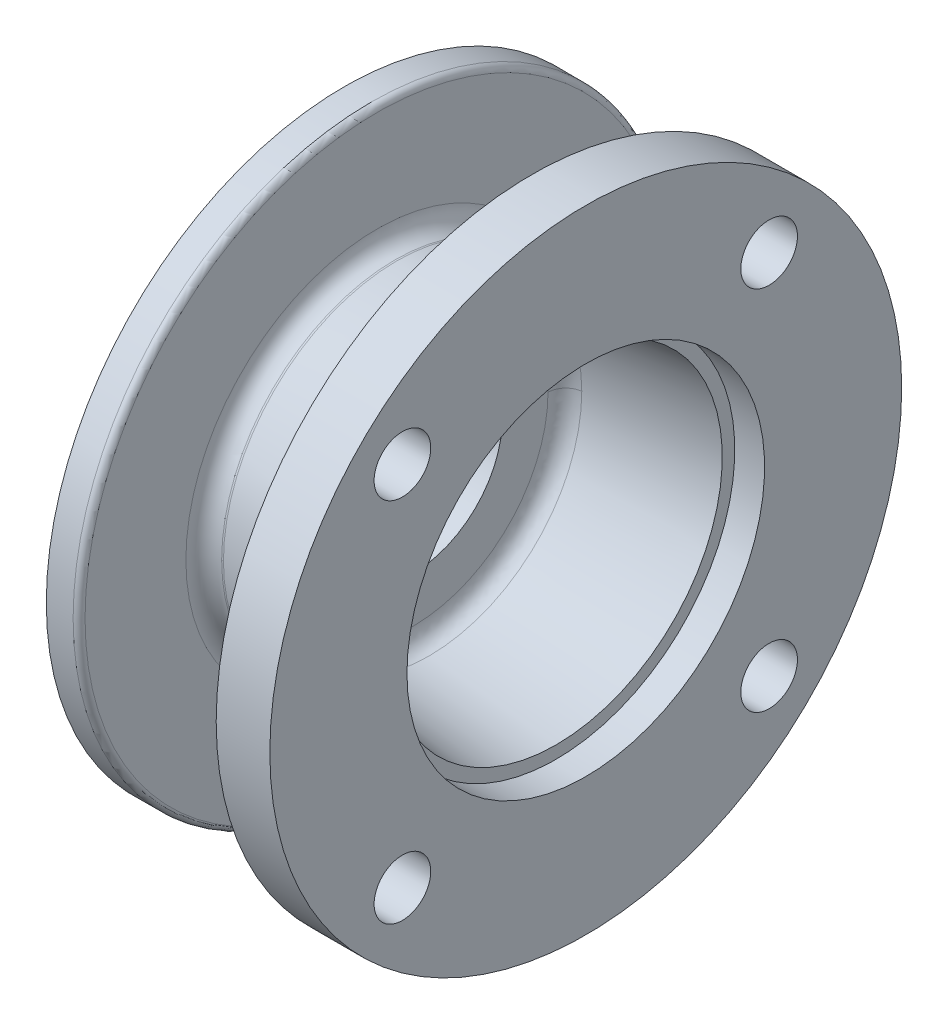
ISO-10303-21;
HEADER;
FILE_DESCRIPTION(('STEP AP214'),'2;1');
FILE_NAME('part.step','',(''),(''),'','','');
FILE_SCHEMA(('AUTOMOTIVE_DESIGN { 1 0 10303 214 1 1 1 1 }'));
ENDSEC;
DATA;
#1=APPLICATION_CONTEXT('core data for automotive mechanical design processes');
#2=APPLICATION_PROTOCOL_DEFINITION('international standard','automotive_design',2000,#1);
#3=PRODUCT_CONTEXT('',#1,'mechanical');
#4=PRODUCT('Part','Part','',(#3));
#5=PRODUCT_RELATED_PRODUCT_CATEGORY('part','',(#4));
#6=PRODUCT_DEFINITION_FORMATION('','',#4);
#7=PRODUCT_DEFINITION_CONTEXT('part definition',#1,'design');
#8=PRODUCT_DEFINITION('design','',#6,#7);
#9=PRODUCT_DEFINITION_SHAPE('','',#8);
#10=(LENGTH_UNIT() NAMED_UNIT(*) SI_UNIT(.MILLI.,.METRE.));
#11=(NAMED_UNIT(*) PLANE_ANGLE_UNIT() SI_UNIT($,.RADIAN.));
#12=(NAMED_UNIT(*) SI_UNIT($,.STERADIAN.) SOLID_ANGLE_UNIT());
#13=UNCERTAINTY_MEASURE_WITH_UNIT(LENGTH_MEASURE(1.E-05),#10,'distance_accuracy_value','');
#14=(GEOMETRIC_REPRESENTATION_CONTEXT(3) GLOBAL_UNCERTAINTY_ASSIGNED_CONTEXT((#13)) GLOBAL_UNIT_ASSIGNED_CONTEXT((#10,
#11,#12)) REPRESENTATION_CONTEXT('',''));
#15=CARTESIAN_POINT('',(0.,0.,0.));
#16=DIRECTION('',(0.,0.,1.));
#17=DIRECTION('',(1.,0.,0.));
#18=AXIS2_PLACEMENT_3D('',#15,#16,#17);
#19=CARTESIAN_POINT('',(14.184452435,0.,0.));
#20=DIRECTION('',(1.,0.,0.));
#21=DIRECTION('',(0.,1.,0.));
#22=AXIS2_PLACEMENT_3D('',#19,#20,#21);
#23=CONICAL_SURFACE('',#22,25.646235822,0.105377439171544);
#24=CARTESIAN_POINT('',(14.184452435,0.,0.));
#25=DIRECTION('',(-1.,0.,0.));
#26=DIRECTION('',(0.,0.,1.));
#27=AXIS2_PLACEMENT_3D('',#24,#25,#26);
#28=CIRCLE('',#27,25.646235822);
#29=CARTESIAN_POINT('',(14.184452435,0.,-25.646235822));
#30=VERTEX_POINT('',#29);
#31=CARTESIAN_POINT('',(14.184452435,-2.63006544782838E-09,25.646235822));
#32=VERTEX_POINT('',#31);
#33=EDGE_CURVE('E62',#30,#32,#28,.T.);
#34=ORIENTED_EDGE('',*,*,#33,.T.);
#35=CARTESIAN_POINT('',(14.184452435,0.,0.));
#36=DIRECTION('',(-1.,0.,0.));
#37=DIRECTION('',(0.,0.,1.));
#38=AXIS2_PLACEMENT_3D('',#35,#36,#37);
#39=CIRCLE('',#38,25.646235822);
#40=EDGE_CURVE('E68',#32,#30,#39,.T.);
#41=ORIENTED_EDGE('',*,*,#40,.T.);
#42=EDGE_LOOP('',(#34,#41));
#43=FACE_BOUND('',#42,.T.);
#44=CARTESIAN_POINT('',(35.5,0.,0.));
#45=DIRECTION('',(1.,0.,0.));
#46=DIRECTION('',(0.,1.,0.));
#47=AXIS2_PLACEMENT_3D('',#44,#45,#46);
#48=CIRCLE('',#47,27.900764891);
#49=CARTESIAN_POINT('',(35.5,27.900764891,0.));
#50=VERTEX_POINT('',#49);
#51=EDGE_CURVE('E20',#50,#50,#48,.T.);
#52=ORIENTED_EDGE('',*,*,#51,.T.);
#53=EDGE_LOOP('',(#52));
#54=FACE_BOUND('',#53,.T.);
#55=ADVANCED_FACE('F16',(#43,#54),#23,.F.);
#56=CARTESIAN_POINT('',(35.5,-30.36,-30.36));
#57=DIRECTION('',(-1.,0.,0.));
#58=DIRECTION('',(0.,0.,1.));
#59=AXIS2_PLACEMENT_3D('',#56,#57,#58);
#60=PLANE('',#59);
#61=ORIENTED_EDGE('',*,*,#51,.F.);
#62=EDGE_LOOP('',(#61));
#63=FACE_BOUND('',#62,.T.);
#64=CARTESIAN_POINT('',(35.5,0.,0.));
#65=DIRECTION('',(-1.,0.,0.));
#66=DIRECTION('',(0.,0.,1.));
#67=AXIS2_PLACEMENT_3D('',#64,#65,#66);
#68=CIRCLE('',#67,30.);
#69=CARTESIAN_POINT('',(35.5,0.,30.));
#70=VERTEX_POINT('',#69);
#71=EDGE_CURVE('E144',#70,#70,#68,.T.);
#72=ORIENTED_EDGE('',*,*,#71,.F.);
#73=EDGE_LOOP('',(#72));
#74=FACE_BOUND('',#73,.T.);
#75=ADVANCED_FACE('F115',(#63,#74),#60,.F.);
#76=CARTESIAN_POINT('',(11.5,0.,-22.662877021));
#77=CARTESIAN_POINT('',(11.5,-45.325754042,-22.662877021));
#78=CARTESIAN_POINT('',(11.5,-45.325754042,22.662877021));
#79=CARTESIAN_POINT('',(11.5,0.,22.662877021));
#80=CARTESIAN_POINT('',(11.5,0.,-24.276770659));
#81=CARTESIAN_POINT('',(11.5,-48.553541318,-24.276770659));
#82=CARTESIAN_POINT('',(11.5,-48.553541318,24.276770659));
#83=CARTESIAN_POINT('',(11.5,0.,24.276770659));
#84=CARTESIAN_POINT('',(12.579511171,0.,-25.476482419));
#85=CARTESIAN_POINT('',(12.579511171,-50.952964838,-25.476482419));
#86=CARTESIAN_POINT('',(12.579511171,-50.952964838,25.476482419));
#87=CARTESIAN_POINT('',(12.579511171,0.,25.476482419));
#88=CARTESIAN_POINT('',(14.184452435,0.,-25.646235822));
#89=CARTESIAN_POINT('',(14.184452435,-51.292471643,-25.646235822));
#90=CARTESIAN_POINT('',(14.184452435,-51.292471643,25.646235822));
#91=CARTESIAN_POINT('',(14.184452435,0.,25.646235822));
#92=(BOUNDED_SURFACE() B_SPLINE_SURFACE(3,3,((#76,#77,#78,#79),(#80,#81,#82,#83),(#84,#85,#86,
#87),(#88,#89,#90,#91)),.UNSPECIFIED.,.F.,.F.,.F.) B_SPLINE_SURFACE_WITH_KNOTS((4,4),(4,4),(0.,
1.),(0.,1.),.UNSPECIFIED.) GEOMETRIC_REPRESENTATION_ITEM() RATIONAL_B_SPLINE_SURFACE(((1.,
0.333333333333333,0.333333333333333,1.),(0.828909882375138,0.276303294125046,0.276303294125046,
0.828909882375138),(0.828909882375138,0.276303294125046,0.276303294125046,0.828909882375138),
(1.,0.333333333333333,0.333333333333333,1.))) REPRESENTATION_ITEM('') SURFACE());
#93=CARTESIAN_POINT('',(11.5,0.,-22.662877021));
#94=CARTESIAN_POINT('',(11.5,0.,-24.276770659));
#95=CARTESIAN_POINT('',(12.579511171,0.,-25.476482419));
#96=CARTESIAN_POINT('',(14.184452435,0.,-25.646235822));
#97=(BOUNDED_CURVE() B_SPLINE_CURVE(3,(#93,#94,#95,#96),.UNSPECIFIED.,.F.,
.F.) B_SPLINE_CURVE_WITH_KNOTS((4,4),(0.,1.),
.UNSPECIFIED.) CURVE() GEOMETRIC_REPRESENTATION_ITEM() RATIONAL_B_SPLINE_CURVE((1.,
0.828909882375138,0.828909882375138,1.)) REPRESENTATION_ITEM(''));
#98=CARTESIAN_POINT('',(11.5,0.,-22.6628770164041));
#99=VERTEX_POINT('',#98);
#100=EDGE_CURVE('E76',#30,#99,#97,.F.);
#101=CARTESIAN_POINT('',(11.5,0.,-22.662877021));
#102=CARTESIAN_POINT('',(11.5,-45.325754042,-22.662877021));
#103=CARTESIAN_POINT('',(11.5,-45.325754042,22.662877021));
#104=CARTESIAN_POINT('',(11.5,0.,22.662877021));
#105=(BOUNDED_CURVE() B_SPLINE_CURVE(3,(#101,#102,#103,#104),.UNSPECIFIED.,.F.,
.F.) B_SPLINE_CURVE_WITH_KNOTS((4,4),(0.,1.),
.UNSPECIFIED.) CURVE() GEOMETRIC_REPRESENTATION_ITEM() RATIONAL_B_SPLINE_CURVE((0.999999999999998,
0.333333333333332,0.333333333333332,0.999999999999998)) REPRESENTATION_ITEM(''));
#106=CARTESIAN_POINT('',(11.5,0.,22.6628770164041));
#107=VERTEX_POINT('',#106);
#108=EDGE_CURVE('E81',#99,#107,#105,.T.);
#109=CARTESIAN_POINT('',(11.5,0.,22.662877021));
#110=CARTESIAN_POINT('',(11.5,0.,24.276770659));
#111=CARTESIAN_POINT('',(12.579511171,0.,25.476482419));
#112=CARTESIAN_POINT('',(14.184452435,0.,25.646235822));
#113=(BOUNDED_CURVE() B_SPLINE_CURVE(3,(#109,#110,#111,#112),.UNSPECIFIED.,.F.,
.F.) B_SPLINE_CURVE_WITH_KNOTS((4,4),(0.,1.),
.UNSPECIFIED.) CURVE() GEOMETRIC_REPRESENTATION_ITEM() RATIONAL_B_SPLINE_CURVE((1.,
0.828909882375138,0.828909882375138,1.)) REPRESENTATION_ITEM(''));
#114=EDGE_CURVE('E70',#107,#32,#113,.T.);
#115=ORIENTED_EDGE('',*,*,#100,.T.);
#116=ORIENTED_EDGE('',*,*,#108,.T.);
#117=ORIENTED_EDGE('',*,*,#114,.T.);
#118=ORIENTED_EDGE('',*,*,#33,.F.);
#119=EDGE_LOOP('',(#115,#116,#117,#118));
#120=FACE_BOUND('',#119,.T.);
#121=ADVANCED_FACE('F80',(#120),#92,.F.);
#122=CARTESIAN_POINT('',(11.5,0.,22.662877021));
#123=CARTESIAN_POINT('',(11.5,45.325754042,22.662877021));
#124=CARTESIAN_POINT('',(11.5,45.325754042,-22.662877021));
#125=CARTESIAN_POINT('',(11.5,0.,-22.662877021));
#126=CARTESIAN_POINT('',(11.5,0.,24.276770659));
#127=CARTESIAN_POINT('',(11.5,48.553541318,24.276770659));
#128=CARTESIAN_POINT('',(11.5,48.553541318,-24.276770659));
#129=CARTESIAN_POINT('',(11.5,0.,-24.276770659));
#130=CARTESIAN_POINT('',(12.579511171,0.,25.476482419));
#131=CARTESIAN_POINT('',(12.579511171,50.952964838,25.476482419));
#132=CARTESIAN_POINT('',(12.579511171,50.952964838,-25.476482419));
#133=CARTESIAN_POINT('',(12.579511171,0.,-25.476482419));
#134=CARTESIAN_POINT('',(14.184452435,0.,25.646235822));
#135=CARTESIAN_POINT('',(14.184452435,51.292471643,25.646235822));
#136=CARTESIAN_POINT('',(14.184452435,51.292471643,-25.646235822));
#137=CARTESIAN_POINT('',(14.184452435,0.,-25.646235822));
#138=(BOUNDED_SURFACE() B_SPLINE_SURFACE(3,3,((#122,#123,#124,#125),(#126,#127,#128,#129),(#130,
#131,#132,#133),(#134,#135,#136,#137)),.UNSPECIFIED.,.F.,.F.,
.F.) B_SPLINE_SURFACE_WITH_KNOTS((4,4),(4,4),(0.,1.),(0.,1.),
.UNSPECIFIED.) GEOMETRIC_REPRESENTATION_ITEM() RATIONAL_B_SPLINE_SURFACE(((1.,0.333333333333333,
0.333333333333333,1.),(0.828909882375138,0.276303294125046,0.276303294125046,0.828909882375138),
(0.828909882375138,0.276303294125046,0.276303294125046,0.828909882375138),(1.,0.333333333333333,
0.333333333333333,1.))) REPRESENTATION_ITEM('') SURFACE());
#139=CARTESIAN_POINT('',(11.5,0.,22.662877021));
#140=CARTESIAN_POINT('',(11.5,45.3257540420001,22.662877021));
#141=CARTESIAN_POINT('',(11.5,45.3257540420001,-22.662877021));
#142=CARTESIAN_POINT('',(11.5,0.,-22.662877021));
#143=(BOUNDED_CURVE() B_SPLINE_CURVE(3,(#139,#140,#141,#142),.UNSPECIFIED.,.F.,
.F.) B_SPLINE_CURVE_WITH_KNOTS((4,4),(0.,1.),
.UNSPECIFIED.) CURVE() GEOMETRIC_REPRESENTATION_ITEM() RATIONAL_B_SPLINE_CURVE((0.999999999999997,
0.333333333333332,0.333333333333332,0.999999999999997)) REPRESENTATION_ITEM(''));
#144=EDGE_CURVE('E153',#107,#99,#143,.T.);
#145=ORIENTED_EDGE('',*,*,#40,.F.);
#146=ORIENTED_EDGE('',*,*,#114,.F.);
#147=ORIENTED_EDGE('',*,*,#144,.T.);
#148=ORIENTED_EDGE('',*,*,#100,.F.);
#149=EDGE_LOOP('',(#145,#146,#147,#148));
#150=FACE_BOUND('',#149,.T.);
#151=ADVANCED_FACE('F73',(#150),#138,.F.);
#152=CARTESIAN_POINT('',(40.5,0.,0.));
#153=DIRECTION('',(-1.,0.,0.));
#154=DIRECTION('',(0.,0.,1.));
#155=AXIS2_PLACEMENT_3D('',#152,#153,#154);
#156=CYLINDRICAL_SURFACE('',#155,30.);
#157=CARTESIAN_POINT('',(40.5,0.,0.));
#158=DIRECTION('',(-1.,0.,0.));
#159=DIRECTION('',(0.,0.,1.));
#160=AXIS2_PLACEMENT_3D('',#157,#158,#159);
#161=CIRCLE('',#160,30.);
#162=CARTESIAN_POINT('',(40.5,0.,30.));
#163=VERTEX_POINT('',#162);
#164=EDGE_CURVE('E155',#163,#163,#161,.F.);
#165=ORIENTED_EDGE('',*,*,#164,.T.);
#166=EDGE_LOOP('',(#165));
#167=FACE_BOUND('',#166,.T.);
#168=ORIENTED_EDGE('',*,*,#71,.T.);
#169=EDGE_LOOP('',(#168));
#170=FACE_BOUND('',#169,.T.);
#171=ADVANCED_FACE('F126',(#167,#170),#156,.F.);
#172=CARTESIAN_POINT('',(11.5,-22.934831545,-22.934831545));
#173=DIRECTION('',(-1.,0.,0.));
#174=DIRECTION('',(0.,0.,1.));
#175=AXIS2_PLACEMENT_3D('',#172,#173,#174);
#176=PLANE('',#175);
#177=CARTESIAN_POINT('',(11.5,0.,0.));
#178=DIRECTION('',(-1.,0.,0.));
#179=DIRECTION('',(0.,0.,1.));
#180=AXIS2_PLACEMENT_3D('',#177,#178,#179);
#181=CIRCLE('',#180,15.);
#182=CARTESIAN_POINT('',(11.5,0.,15.));
#183=VERTEX_POINT('',#182);
#184=EDGE_CURVE('E158',#183,#183,#181,.F.);
#185=ORIENTED_EDGE('',*,*,#184,.F.);
#186=EDGE_LOOP('',(#185));
#187=FACE_BOUND('',#186,.T.);
#188=ORIENTED_EDGE('',*,*,#108,.F.);
#189=ORIENTED_EDGE('',*,*,#144,.F.);
#190=EDGE_LOOP('',(#188,#189));
#191=FACE_BOUND('',#190,.T.);
#192=ADVANCED_FACE('F259',(#187,#191),#176,.F.);
#193=CARTESIAN_POINT('',(40.5,-53.636,-53.636));
#194=DIRECTION('',(-1.,0.,0.));
#195=DIRECTION('',(0.,0.,1.));
#196=AXIS2_PLACEMENT_3D('',#193,#194,#195);
#197=PLANE('',#196);
#198=ORIENTED_EDGE('',*,*,#164,.F.);
#199=EDGE_LOOP('',(#198));
#200=FACE_BOUND('',#199,.T.);
#201=CARTESIAN_POINT('',(40.5,30.759144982,-30.759144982));
#202=DIRECTION('',(1.,0.,0.));
#203=DIRECTION('',(0.,0.,-1.));
#204=AXIS2_PLACEMENT_3D('',#201,#202,#203);
#205=CIRCLE('',#204,4.75);
#206=CARTESIAN_POINT('',(40.5,30.759144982,-35.509144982));
#207=VERTEX_POINT('',#206);
#208=EDGE_CURVE('E178',#207,#207,#205,.T.);
#209=ORIENTED_EDGE('',*,*,#208,.F.);
#210=EDGE_LOOP('',(#209));
#211=FACE_BOUND('',#210,.T.);
#212=CARTESIAN_POINT('',(40.5,30.759144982,30.759144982));
#213=DIRECTION('',(1.,0.,0.));
#214=DIRECTION('',(0.,0.,-1.));
#215=AXIS2_PLACEMENT_3D('',#212,#213,#214);
#216=CIRCLE('',#215,4.75);
#217=CARTESIAN_POINT('',(40.5,30.759144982,26.009144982));
#218=VERTEX_POINT('',#217);
#219=EDGE_CURVE('E174',#218,#218,#216,.T.);
#220=ORIENTED_EDGE('',*,*,#219,.F.);
#221=EDGE_LOOP('',(#220));
#222=FACE_BOUND('',#221,.T.);
#223=CARTESIAN_POINT('',(40.5,-30.759144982,-30.759144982));
#224=DIRECTION('',(1.,0.,0.));
#225=DIRECTION('',(0.,0.,-1.));
#226=AXIS2_PLACEMENT_3D('',#223,#224,#225);
#227=CIRCLE('',#226,4.75);
#228=CARTESIAN_POINT('',(40.5,-30.759144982,-35.509144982));
#229=VERTEX_POINT('',#228);
#230=EDGE_CURVE('E170',#229,#229,#227,.T.);
#231=ORIENTED_EDGE('',*,*,#230,.F.);
#232=EDGE_LOOP('',(#231));
#233=FACE_BOUND('',#232,.T.);
#234=CARTESIAN_POINT('',(40.5,-30.759144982,30.759144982));
#235=DIRECTION('',(1.,0.,0.));
#236=DIRECTION('',(0.,0.,-1.));
#237=AXIS2_PLACEMENT_3D('',#234,#235,#236);
#238=CIRCLE('',#237,4.75);
#239=CARTESIAN_POINT('',(40.5,-30.759144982,26.009144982));
#240=VERTEX_POINT('',#239);
#241=EDGE_CURVE('E166',#240,#240,#238,.T.);
#242=ORIENTED_EDGE('',*,*,#241,.F.);
#243=EDGE_LOOP('',(#242));
#244=FACE_BOUND('',#243,.T.);
#245=CARTESIAN_POINT('',(40.5,0.,0.));
#246=DIRECTION('',(-1.,0.,0.));
#247=DIRECTION('',(0.,0.,1.));
#248=AXIS2_PLACEMENT_3D('',#245,#246,#247);
#249=CIRCLE('',#248,53.);
#250=CARTESIAN_POINT('',(40.5,0.,53.));
#251=VERTEX_POINT('',#250);
#252=EDGE_CURVE('E162',#251,#251,#249,.F.);
#253=ORIENTED_EDGE('',*,*,#252,.T.);
#254=EDGE_LOOP('',(#253));
#255=FACE_BOUND('',#254,.T.);
#256=ADVANCED_FACE('F268',(#200,#211,#222,#233,#244,#255),#197,.F.);
#257=CARTESIAN_POINT('',(11.5,0.,0.));
#258=DIRECTION('',(-1.,0.,0.));
#259=DIRECTION('',(0.,0.,1.));
#260=AXIS2_PLACEMENT_3D('',#257,#258,#259);
#261=CYLINDRICAL_SURFACE('',#260,15.);
#262=ORIENTED_EDGE('',*,*,#184,.T.);
#263=EDGE_LOOP('',(#262));
#264=FACE_BOUND('',#263,.T.);
#265=CARTESIAN_POINT('',(0.,0.,0.));
#266=DIRECTION('',(-1.,0.,0.));
#267=DIRECTION('',(0.,0.,1.));
#268=AXIS2_PLACEMENT_3D('',#265,#266,#267);
#269=CIRCLE('',#268,15.);
#270=CARTESIAN_POINT('',(0.,0.,15.));
#271=VERTEX_POINT('',#270);
#272=EDGE_CURVE('E182',#271,#271,#269,.T.);
#273=ORIENTED_EDGE('',*,*,#272,.T.);
#274=EDGE_LOOP('',(#273));
#275=FACE_BOUND('',#274,.T.);
#276=ADVANCED_FACE('F410',(#264,#275),#261,.F.);
#277=CARTESIAN_POINT('',(40.5,0.,0.));
#278=DIRECTION('',(-1.,0.,0.));
#279=DIRECTION('',(0.,0.,1.));
#280=AXIS2_PLACEMENT_3D('',#277,#278,#279);
#281=CYLINDRICAL_SURFACE('',#280,53.);
#282=CARTESIAN_POINT('',(31.5,0.,0.));
#283=DIRECTION('',(-1.,0.,0.));
#284=DIRECTION('',(0.,0.,1.));
#285=AXIS2_PLACEMENT_3D('',#282,#283,#284);
#286=CIRCLE('',#285,53.);
#287=CARTESIAN_POINT('',(31.5,0.,53.));
#288=VERTEX_POINT('',#287);
#289=EDGE_CURVE('E186',#288,#288,#286,.F.);
#290=ORIENTED_EDGE('',*,*,#289,.T.);
#291=EDGE_LOOP('',(#290));
#292=FACE_BOUND('',#291,.T.);
#293=ORIENTED_EDGE('',*,*,#252,.F.);
#294=EDGE_LOOP('',(#293));
#295=FACE_BOUND('',#294,.T.);
#296=ADVANCED_FACE('F406',(#292,#295),#281,.T.);
#297=CARTESIAN_POINT('',(31.5,-30.759144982,30.759144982));
#298=DIRECTION('',(1.,0.,0.));
#299=DIRECTION('',(0.,0.,-1.));
#300=AXIS2_PLACEMENT_3D('',#297,#298,#299);
#301=CYLINDRICAL_SURFACE('',#300,4.75);
#302=ORIENTED_EDGE('',*,*,#241,.T.);
#303=EDGE_LOOP('',(#302));
#304=FACE_BOUND('',#303,.T.);
#305=CARTESIAN_POINT('',(31.5,-30.759144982,30.759144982));
#306=DIRECTION('',(1.,0.,0.));
#307=DIRECTION('',(0.,0.,-1.));
#308=AXIS2_PLACEMENT_3D('',#305,#306,#307);
#309=CIRCLE('',#308,4.75);
#310=CARTESIAN_POINT('',(31.5,-30.759144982,26.009144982));
#311=VERTEX_POINT('',#310);
#312=EDGE_CURVE('E190',#311,#311,#309,.F.);
#313=ORIENTED_EDGE('',*,*,#312,.T.);
#314=EDGE_LOOP('',(#313));
#315=FACE_BOUND('',#314,.T.);
#316=ADVANCED_FACE('F409',(#304,#315),#301,.F.);
#317=CARTESIAN_POINT('',(31.5,-30.759144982,-30.759144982));
#318=DIRECTION('',(1.,0.,0.));
#319=DIRECTION('',(0.,0.,-1.));
#320=AXIS2_PLACEMENT_3D('',#317,#318,#319);
#321=CYLINDRICAL_SURFACE('',#320,4.75);
#322=ORIENTED_EDGE('',*,*,#230,.T.);
#323=EDGE_LOOP('',(#322));
#324=FACE_BOUND('',#323,.T.);
#325=CARTESIAN_POINT('',(31.5,-30.759144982,-30.759144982));
#326=DIRECTION('',(1.,0.,0.));
#327=DIRECTION('',(0.,0.,-1.));
#328=AXIS2_PLACEMENT_3D('',#325,#326,#327);
#329=CIRCLE('',#328,4.75);
#330=CARTESIAN_POINT('',(31.5,-30.759144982,-35.509144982));
#331=VERTEX_POINT('',#330);
#332=EDGE_CURVE('E194',#331,#331,#329,.F.);
#333=ORIENTED_EDGE('',*,*,#332,.T.);
#334=EDGE_LOOP('',(#333));
#335=FACE_BOUND('',#334,.T.);
#336=ADVANCED_FACE('F432',(#324,#335),#321,.F.);
#337=CARTESIAN_POINT('',(31.5,30.759144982,30.759144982));
#338=DIRECTION('',(1.,0.,0.));
#339=DIRECTION('',(0.,0.,-1.));
#340=AXIS2_PLACEMENT_3D('',#337,#338,#339);
#341=CYLINDRICAL_SURFACE('',#340,4.75);
#342=ORIENTED_EDGE('',*,*,#219,.T.);
#343=EDGE_LOOP('',(#342));
#344=FACE_BOUND('',#343,.T.);
#345=CARTESIAN_POINT('',(31.5,30.759144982,30.759144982));
#346=DIRECTION('',(1.,0.,0.));
#347=DIRECTION('',(0.,0.,-1.));
#348=AXIS2_PLACEMENT_3D('',#345,#346,#347);
#349=CIRCLE('',#348,4.75);
#350=CARTESIAN_POINT('',(31.5,30.759144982,26.009144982));
#351=VERTEX_POINT('',#350);
#352=EDGE_CURVE('E198',#351,#351,#349,.F.);
#353=ORIENTED_EDGE('',*,*,#352,.T.);
#354=EDGE_LOOP('',(#353));
#355=FACE_BOUND('',#354,.T.);
#356=ADVANCED_FACE('F437',(#344,#355),#341,.F.);
#357=CARTESIAN_POINT('',(31.5,30.759144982,-30.759144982));
#358=DIRECTION('',(1.,0.,0.));
#359=DIRECTION('',(0.,0.,-1.));
#360=AXIS2_PLACEMENT_3D('',#357,#358,#359);
#361=CYLINDRICAL_SURFACE('',#360,4.75);
#362=ORIENTED_EDGE('',*,*,#208,.T.);
#363=EDGE_LOOP('',(#362));
#364=FACE_BOUND('',#363,.T.);
#365=CARTESIAN_POINT('',(31.5,30.759144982,-30.759144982));
#366=DIRECTION('',(1.,0.,0.));
#367=DIRECTION('',(0.,0.,-1.));
#368=AXIS2_PLACEMENT_3D('',#365,#366,#367);
#369=CIRCLE('',#368,4.75);
#370=CARTESIAN_POINT('',(31.5,30.759144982,-35.509144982));
#371=VERTEX_POINT('',#370);
#372=EDGE_CURVE('E202',#371,#371,#369,.F.);
#373=ORIENTED_EDGE('',*,*,#372,.T.);
#374=EDGE_LOOP('',(#373));
#375=FACE_BOUND('',#374,.T.);
#376=ADVANCED_FACE('F443',(#364,#375),#361,.F.);
#377=CARTESIAN_POINT('',(0.,-50.6,50.6));
#378=DIRECTION('',(1.,0.,0.));
#379=DIRECTION('',(0.,0.,-1.));
#380=AXIS2_PLACEMENT_3D('',#377,#378,#379);
#381=PLANE('',#380);
#382=ORIENTED_EDGE('',*,*,#272,.F.);
#383=EDGE_LOOP('',(#382));
#384=FACE_BOUND('',#383,.T.);
#385=CARTESIAN_POINT('',(0.,0.,0.));
#386=DIRECTION('',(-1.,0.,0.));
#387=DIRECTION('',(0.,0.,1.));
#388=AXIS2_PLACEMENT_3D('',#385,#386,#387);
#389=CIRCLE('',#388,50.);
#390=CARTESIAN_POINT('',(0.,0.,50.));
#391=VERTEX_POINT('',#390);
#392=EDGE_CURVE('E207',#391,#391,#389,.T.);
#393=ORIENTED_EDGE('',*,*,#392,.T.);
#394=EDGE_LOOP('',(#393));
#395=FACE_BOUND('',#394,.T.);
#396=ADVANCED_FACE('F238',(#384,#395),#381,.F.);
#397=CARTESIAN_POINT('',(31.5,-53.636,53.636));
#398=DIRECTION('',(1.,0.,0.));
#399=DIRECTION('',(0.,0.,-1.));
#400=AXIS2_PLACEMENT_3D('',#397,#398,#399);
#401=PLANE('',#400);
#402=CARTESIAN_POINT('',(31.5,0.,-34.199426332));
#403=CARTESIAN_POINT('',(31.5,-0.361867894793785,-34.1994284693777));
#404=CARTESIAN_POINT('',(31.5,-0.723736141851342,-34.1936829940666));
#405=CARTESIAN_POINT('',(31.5,-1.45858225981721,-34.1703474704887));
#406=CARTESIAN_POINT('',(31.5,-1.83154841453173,-34.1523874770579));
#407=CARTESIAN_POINT('',(31.5,-2.5884930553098,-34.1035017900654));
#408=CARTESIAN_POINT('',(31.5,-2.97244621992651,-34.0721834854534));
#409=CARTESIAN_POINT('',(31.5,-3.75118205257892,-33.9954006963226));
#410=CARTESIAN_POINT('',(31.5,-4.14592378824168,-33.949520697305));
#411=CARTESIAN_POINT('',(31.5,-4.94595592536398,-33.8423735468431));
#412=CARTESIAN_POINT('',(31.5,-5.35118763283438,-33.7806678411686));
#413=CARTESIAN_POINT('',(31.5,-6.17180774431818,-33.6405735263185));
#414=CARTESIAN_POINT('',(31.5,-6.58711742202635,-33.5617235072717));
#415=CARTESIAN_POINT('',(31.5,-7.42737653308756,-33.3859962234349));
#416=CARTESIAN_POINT('',(31.5,-7.85222484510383,-33.2886352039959));
#417=CARTESIAN_POINT('',(31.5,-8.71090501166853,-33.0745018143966));
#418=CARTESIAN_POINT('',(31.5,-9.14461093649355,-32.9572242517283));
#419=CARTESIAN_POINT('',(31.5,-10.02019633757,-32.7018451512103));
#420=CARTESIAN_POINT('',(31.5,-10.461922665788,-32.5632183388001));
#421=CARTESIAN_POINT('',(31.5,-11.3525707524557,-32.2637136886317));
#422=CARTESIAN_POINT('',(31.5,-11.8013098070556,-32.1022923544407));
#423=CARTESIAN_POINT('',(31.5,-12.7048233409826,-31.7557743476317));
#424=CARTESIAN_POINT('',(31.5,-13.1593833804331,-31.5701183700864));
#425=CARTESIAN_POINT('',(31.5,-14.073184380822,-31.1737299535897));
#426=CARTESIAN_POINT('',(31.5,-14.5321772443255,-30.9624254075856));
#427=CARTESIAN_POINT('',(31.5,-15.4532840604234,-30.5133857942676));
#428=CARTESIAN_POINT('',(31.5,-15.9151147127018,-30.2750694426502));
#429=CARTESIAN_POINT('',(31.5,-16.8401236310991,-29.7707265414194));
#430=CARTESIAN_POINT('',(31.5,-17.3029823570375,-29.5041137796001));
#431=CARTESIAN_POINT('',(31.5,-18.228055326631,-28.9420034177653));
#432=CARTESIAN_POINT('',(31.5,-18.689913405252,-28.6459195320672));
#433=CARTESIAN_POINT('',(31.5,-19.6107735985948,-28.0238310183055));
#434=CARTESIAN_POINT('',(31.5,-20.0693833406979,-27.6972454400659));
#435=CARTESIAN_POINT('',(31.5,-20.9813203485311,-27.0132926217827));
#436=CARTESIAN_POINT('',(31.5,-21.4342204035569,-26.6553556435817));
#437=CARTESIAN_POINT('',(31.5,-22.3321068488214,-25.908052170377));
#438=CARTESIAN_POINT('',(31.5,-22.7766336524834,-25.5181333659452));
#439=CARTESIAN_POINT('',(31.5,-23.6549549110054,-24.7064703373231));
#440=CARTESIAN_POINT('',(31.5,-24.0882610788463,-24.2841976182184));
#441=CARTESIAN_POINT('',(31.5,-24.9411594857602,-23.4077214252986));
#442=CARTESIAN_POINT('',(31.5,-25.3602397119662,-22.9530196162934));
#443=CARTESIAN_POINT('',(31.5,-26.1815744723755,-22.0119067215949));
#444=CARTESIAN_POINT('',(31.5,-26.5832995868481,-21.5250335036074));
#445=CARTESIAN_POINT('',(31.5,-27.3667221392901,-20.5201606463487));
#446=CARTESIAN_POINT('',(31.5,-27.7478803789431,-20.001740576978));
#447=CARTESIAN_POINT('',(31.5,-28.4869277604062,-18.934740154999));
#448=CARTESIAN_POINT('',(31.5,-28.8442768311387,-18.3857855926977));
#449=CARTESIAN_POINT('',(31.5,-29.5324712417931,-17.2591081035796));
#450=CARTESIAN_POINT('',(31.5,-29.8627854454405,-16.6810609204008));
#451=CARTESIAN_POINT('',(31.5,-30.4937790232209,-15.4979425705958));
#452=CARTESIAN_POINT('',(31.5,-30.7939473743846,-14.8925980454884));
#453=CARTESIAN_POINT('',(31.5,-31.2183068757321,-13.9690539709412));
#454=CARTESIAN_POINT('',(31.5,-31.3560669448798,-13.6570191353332));
#455=CARTESIAN_POINT('',(31.5,-31.6230101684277,-13.0270378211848));
#456=CARTESIAN_POINT('',(31.5,-31.7521357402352,-12.7090668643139));
#457=CARTESIAN_POINT('',(31.5,-32.0014626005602,-12.0675702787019));
#458=CARTESIAN_POINT('',(31.5,-32.1216090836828,-11.7440233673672));
#459=CARTESIAN_POINT('',(31.5,-32.3526570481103,-11.0917392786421));
#460=CARTESIAN_POINT('',(31.5,-32.4635068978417,-10.7629838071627));
#461=CARTESIAN_POINT('',(31.5,-32.6756580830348,-10.1006744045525));
#462=CARTESIAN_POINT('',(31.5,-32.7769112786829,-9.76710505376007));
#463=CARTESIAN_POINT('',(31.5,-32.9695879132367,-9.09558011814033));
#464=CARTESIAN_POINT('',(31.5,-33.0609670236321,-8.75761181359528));
#465=CARTESIAN_POINT('',(31.5,-33.2336375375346,-8.07772167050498));
#466=CARTESIAN_POINT('',(31.5,-33.3148887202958,-7.73578961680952));
#467=CARTESIAN_POINT('',(31.5,-33.4670706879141,-7.048423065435));
#468=CARTESIAN_POINT('',(31.5,-33.5379656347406,-6.70298063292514));
#469=CARTESIAN_POINT('',(31.5,-33.6692292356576,-6.00906107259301));
#470=CARTESIAN_POINT('',(31.5,-33.7295666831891,-5.66057804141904));
#471=CARTESIAN_POINT('',(31.5,-33.8395376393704,-4.96105965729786));
#472=CARTESIAN_POINT('',(31.5,-33.8891447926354,-4.61002016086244));
#473=CARTESIAN_POINT('',(31.5,-33.9775070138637,-3.9058837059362));
#474=CARTESIAN_POINT('',(31.5,-34.0162407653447,-3.55278407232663));
#475=CARTESIAN_POINT('',(31.5,-34.082738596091,-2.84503241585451));
#476=CARTESIAN_POINT('',(31.5,-34.110486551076,-2.49037887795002));
#477=CARTESIAN_POINT('',(31.5,-34.1549266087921,-1.78003232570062));
#478=CARTESIAN_POINT('',(31.5,-34.171607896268,-1.42433863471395));
#479=CARTESIAN_POINT('',(31.5,-34.19386047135,-0.712430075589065));
#480=CARTESIAN_POINT('',(31.5,-34.1994263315,-0.356215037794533));
#481=CARTESIAN_POINT('',(31.5,-34.1994263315,0.356215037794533));
#482=CARTESIAN_POINT('',(31.5,-34.19386047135,0.712430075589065));
#483=CARTESIAN_POINT('',(31.5,-34.171607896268,1.42433863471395));
#484=CARTESIAN_POINT('',(31.5,-34.1549266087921,1.78003232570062));
#485=CARTESIAN_POINT('',(31.5,-34.110486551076,2.49037887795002));
#486=CARTESIAN_POINT('',(31.5,-34.082738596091,2.84503241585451));
#487=CARTESIAN_POINT('',(31.5,-34.0162407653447,3.55278407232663));
#488=CARTESIAN_POINT('',(31.5,-33.9775070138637,3.9058837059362));
#489=CARTESIAN_POINT('',(31.5,-33.8891447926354,4.61002016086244));
#490=CARTESIAN_POINT('',(31.5,-33.8395376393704,4.96105965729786));
#491=CARTESIAN_POINT('',(31.5,-33.7295666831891,5.66057804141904));
#492=CARTESIAN_POINT('',(31.5,-33.6692292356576,6.00906107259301));
#493=CARTESIAN_POINT('',(31.5,-33.5379656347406,6.70298063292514));
#494=CARTESIAN_POINT('',(31.5,-33.4670706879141,7.048423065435));
#495=CARTESIAN_POINT('',(31.5,-33.3148887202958,7.73578961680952));
#496=CARTESIAN_POINT('',(31.5,-33.2336375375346,8.07772167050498));
#497=CARTESIAN_POINT('',(31.5,-33.0609670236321,8.75761181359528));
#498=CARTESIAN_POINT('',(31.5,-32.9695879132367,9.09558011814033));
#499=CARTESIAN_POINT('',(31.5,-32.7769112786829,9.76710505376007));
#500=CARTESIAN_POINT('',(31.5,-32.6756580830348,10.1006744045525));
#501=CARTESIAN_POINT('',(31.5,-32.4635068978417,10.7629838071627));
#502=CARTESIAN_POINT('',(31.5,-32.3526570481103,11.0917392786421));
#503=CARTESIAN_POINT('',(31.5,-32.1216090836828,11.7440233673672));
#504=CARTESIAN_POINT('',(31.5,-32.0014626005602,12.0675702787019));
#505=CARTESIAN_POINT('',(31.5,-31.7521357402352,12.7090668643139));
#506=CARTESIAN_POINT('',(31.5,-31.6230101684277,13.0270378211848));
#507=CARTESIAN_POINT('',(31.5,-31.3560669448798,13.6570191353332));
#508=CARTESIAN_POINT('',(31.5,-31.2183068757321,13.9690539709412));
#509=CARTESIAN_POINT('',(31.5,-30.7939473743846,14.8925980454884));
#510=CARTESIAN_POINT('',(31.5,-30.4937790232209,15.4979425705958));
#511=CARTESIAN_POINT('',(31.5,-29.8627854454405,16.6810609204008));
#512=CARTESIAN_POINT('',(31.5,-29.5324712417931,17.2591081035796));
#513=CARTESIAN_POINT('',(31.5,-28.8442768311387,18.3857855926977));
#514=CARTESIAN_POINT('',(31.5,-28.4869277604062,18.934740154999));
#515=CARTESIAN_POINT('',(31.5,-27.7478803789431,20.001740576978));
#516=CARTESIAN_POINT('',(31.5,-27.3667221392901,20.5201606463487));
#517=CARTESIAN_POINT('',(31.5,-26.5832995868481,21.5250335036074));
#518=CARTESIAN_POINT('',(31.5,-26.1815744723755,22.0119067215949));
#519=CARTESIAN_POINT('',(31.5,-25.3602397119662,22.9530196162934));
#520=CARTESIAN_POINT('',(31.5,-24.9411594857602,23.4077214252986));
#521=CARTESIAN_POINT('',(31.5,-24.0882610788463,24.2841976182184));
#522=CARTESIAN_POINT('',(31.5,-23.6549549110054,24.7064703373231));
#523=CARTESIAN_POINT('',(31.5,-22.7766336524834,25.5181333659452));
#524=CARTESIAN_POINT('',(31.5,-22.3321068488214,25.908052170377));
#525=CARTESIAN_POINT('',(31.5,-21.4342204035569,26.6553556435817));
#526=CARTESIAN_POINT('',(31.5,-20.9813203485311,27.0132926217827));
#527=CARTESIAN_POINT('',(31.5,-20.0693833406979,27.6972454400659));
#528=CARTESIAN_POINT('',(31.5,-19.6107735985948,28.0238310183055));
#529=CARTESIAN_POINT('',(31.5,-18.689913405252,28.6459195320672));
#530=CARTESIAN_POINT('',(31.5,-18.228055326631,28.9420034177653));
#531=CARTESIAN_POINT('',(31.5,-17.3029823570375,29.5041137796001));
#532=CARTESIAN_POINT('',(31.5,-16.8401236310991,29.7707265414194));
#533=CARTESIAN_POINT('',(31.5,-15.9151147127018,30.2750694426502));
#534=CARTESIAN_POINT('',(31.5,-15.4532840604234,30.5133857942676));
#535=CARTESIAN_POINT('',(31.5,-14.5321772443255,30.9624254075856));
#536=CARTESIAN_POINT('',(31.5,-14.073184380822,31.1737299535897));
#537=CARTESIAN_POINT('',(31.5,-13.1593833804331,31.5701183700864));
#538=CARTESIAN_POINT('',(31.5,-12.7048233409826,31.7557743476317));
#539=CARTESIAN_POINT('',(31.5,-11.8013098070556,32.1022923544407));
#540=CARTESIAN_POINT('',(31.5,-11.3525707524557,32.2637136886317));
#541=CARTESIAN_POINT('',(31.5,-10.461922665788,32.5632183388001));
#542=CARTESIAN_POINT('',(31.5,-10.02019633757,32.7018451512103));
#543=CARTESIAN_POINT('',(31.5,-9.14461093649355,32.9572242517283));
#544=CARTESIAN_POINT('',(31.5,-8.71090501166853,33.0745018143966));
#545=CARTESIAN_POINT('',(31.5,-7.85222484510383,33.2886352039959));
#546=CARTESIAN_POINT('',(31.5,-7.42737653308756,33.3859962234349));
#547=CARTESIAN_POINT('',(31.5,-6.58711742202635,33.5617235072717));
#548=CARTESIAN_POINT('',(31.5,-6.17180774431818,33.6405735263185));
#549=CARTESIAN_POINT('',(31.5,-5.35118763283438,33.7806678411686));
#550=CARTESIAN_POINT('',(31.5,-4.94595592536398,33.8423735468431));
#551=CARTESIAN_POINT('',(31.5,-4.14592378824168,33.949520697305));
#552=CARTESIAN_POINT('',(31.5,-3.75118205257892,33.9954006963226));
#553=CARTESIAN_POINT('',(31.5,-2.97244621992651,34.0721834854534));
#554=CARTESIAN_POINT('',(31.5,-2.5884930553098,34.1035017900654));
#555=CARTESIAN_POINT('',(31.5,-1.83154841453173,34.1523874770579));
#556=CARTESIAN_POINT('',(31.5,-1.45858225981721,34.1703474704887));
#557=CARTESIAN_POINT('',(31.5,-0.723736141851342,34.1936829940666));
#558=CARTESIAN_POINT('',(31.5,-0.361867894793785,34.1994284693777));
#559=CARTESIAN_POINT('',(31.5,0.,34.199426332));
#560=B_SPLINE_CURVE_WITH_KNOTS('',3,(#402,#403,#404,#405,#406,#407,#408,#409,#410,#411,#412,
#413,#414,#415,#416,#417,#418,#419,#420,#421,#422,#423,#424,#425,#426,#427,#428,#429,#430,#431,
#432,#433,#434,#435,#436,#437,#438,#439,#440,#441,#442,#443,#444,#445,#446,#447,#448,#449,#450,
#451,#452,#453,#454,#455,#456,#457,#458,#459,#460,#461,#462,#463,#464,#465,#466,#467,#468,#469,
#470,#471,#472,#473,#474,#475,#476,#477,#478,#479,#480,#481,#482,#483,#484,#485,#486,#487,#488,
#489,#490,#491,#492,#493,#494,#495,#496,#497,#498,#499,#500,#501,#502,#503,#504,#505,#506,#507,
#508,#509,#510,#511,#512,#513,#514,#515,#516,#517,#518,#519,#520,#521,#522,#523,#524,#525,#526,
#527,#528,#529,#530,#531,#532,#533,#534,#535,#536,#537,#538,#539,#540,#541,#542,#543,#544,#545,
#546,#547,#548,#549,#550,#551,#552,#553,#554,#555,#556,#557,#558,#559),.UNSPECIFIED.,.F.,.F.,(4,
2,2,2,2,2,2,2,2,2,2,2,2,2,2,2,2,2,2,2,2,2,2,2,2,2,2,2,2,2,2,2,2,2,2,2,2,2,2,2,2,2,2,2,2,2,2,2,2,
2,2,2,2,2,2,2,2,2,2,2,2,2,2,2,2,2,2,2,2,2,2,2,2,2,2,2,2,2,4),(0.,1.08555932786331,
2.20555412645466,3.36101925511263,4.55297509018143,5.78241872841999,7.05031398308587,
8.35758010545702,9.70507918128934,11.0936021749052,12.5238536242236,13.9964350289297,
15.5118270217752,17.0703704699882,18.6722467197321,20.3174572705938,22.0058032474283,
23.7368651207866,25.5099832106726,27.3242395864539,29.1784420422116,31.0711108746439,
33.0004692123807,34.9644376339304,36.9606337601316,38.9863774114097,40.00952766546,
41.0389328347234,42.0741800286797,43.1148409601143,44.1604728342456,45.2106193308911,
46.2648116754,47.3225697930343,48.383403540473,49.4468140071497,50.5122948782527,
51.5793338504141,52.6474140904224,53.7160157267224,54.7846173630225,55.8526976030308,
56.9197365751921,57.9852174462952,59.0486279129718,60.1094616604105,61.1672197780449,
62.2214121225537,63.2715586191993,64.3171904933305,65.3578514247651,66.3930986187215,
67.4225037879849,68.4456540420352,70.4713976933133,72.4675938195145,74.4315622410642,
76.3609205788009,78.2535894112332,80.107791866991,81.9220482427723,83.6951663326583,
85.4262282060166,87.1145741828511,88.7597847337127,90.3616609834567,91.9202044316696,
93.4355964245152,94.9081778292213,96.3384292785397,97.7269522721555,99.0744513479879,
100.381717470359,101.649612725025,102.879056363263,104.071012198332,105.22647732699,
106.346472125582,107.432031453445),.UNSPECIFIED.);
#561=CARTESIAN_POINT('',(31.5,0.,34.1994263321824));
#562=VERTEX_POINT('',#561);
#563=CARTESIAN_POINT('',(31.5,0.,-34.1994263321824));
#564=VERTEX_POINT('',#563);
#565=EDGE_CURVE('E206',#562,#564,#560,.F.);
#566=ORIENTED_EDGE('',*,*,#565,.T.);
#567=CARTESIAN_POINT('',(31.5,0.,34.199426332));
#568=CARTESIAN_POINT('',(31.5,0.361867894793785,34.1994284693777));
#569=CARTESIAN_POINT('',(31.5,0.723736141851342,34.1936829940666));
#570=CARTESIAN_POINT('',(31.5,1.45858225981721,34.1703474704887));
#571=CARTESIAN_POINT('',(31.5,1.83154841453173,34.1523874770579));
#572=CARTESIAN_POINT('',(31.5,2.5884930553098,34.1035017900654));
#573=CARTESIAN_POINT('',(31.5,2.97244621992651,34.0721834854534));
#574=CARTESIAN_POINT('',(31.5,3.75118205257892,33.9954006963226));
#575=CARTESIAN_POINT('',(31.5,4.14592378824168,33.949520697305));
#576=CARTESIAN_POINT('',(31.5,4.94595592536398,33.8423735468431));
#577=CARTESIAN_POINT('',(31.5,5.35118763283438,33.7806678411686));
#578=CARTESIAN_POINT('',(31.5,6.17180774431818,33.6405735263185));
#579=CARTESIAN_POINT('',(31.5,6.58711742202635,33.5617235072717));
#580=CARTESIAN_POINT('',(31.5,7.42737653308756,33.3859962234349));
#581=CARTESIAN_POINT('',(31.5,7.85222484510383,33.2886352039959));
#582=CARTESIAN_POINT('',(31.5,8.71090501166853,33.0745018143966));
#583=CARTESIAN_POINT('',(31.5,9.14461093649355,32.9572242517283));
#584=CARTESIAN_POINT('',(31.5,10.02019633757,32.7018451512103));
#585=CARTESIAN_POINT('',(31.5,10.461922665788,32.5632183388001));
#586=CARTESIAN_POINT('',(31.5,11.3525707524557,32.2637136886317));
#587=CARTESIAN_POINT('',(31.5,11.8013098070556,32.1022923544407));
#588=CARTESIAN_POINT('',(31.5,12.7048233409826,31.7557743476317));
#589=CARTESIAN_POINT('',(31.5,13.1593833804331,31.5701183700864));
#590=CARTESIAN_POINT('',(31.5,14.073184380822,31.1737299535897));
#591=CARTESIAN_POINT('',(31.5,14.5321772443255,30.9624254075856));
#592=CARTESIAN_POINT('',(31.5,15.4532840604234,30.5133857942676));
#593=CARTESIAN_POINT('',(31.5,15.9151147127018,30.2750694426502));
#594=CARTESIAN_POINT('',(31.5,16.8401236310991,29.7707265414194));
#595=CARTESIAN_POINT('',(31.5,17.3029823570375,29.5041137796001));
#596=CARTESIAN_POINT('',(31.5,18.228055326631,28.9420034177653));
#597=CARTESIAN_POINT('',(31.5,18.689913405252,28.6459195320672));
#598=CARTESIAN_POINT('',(31.5,19.6107735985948,28.0238310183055));
#599=CARTESIAN_POINT('',(31.5,20.0693833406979,27.6972454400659));
#600=CARTESIAN_POINT('',(31.5,20.9813203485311,27.0132926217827));
#601=CARTESIAN_POINT('',(31.5,21.4342204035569,26.6553556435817));
#602=CARTESIAN_POINT('',(31.5,22.3321068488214,25.908052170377));
#603=CARTESIAN_POINT('',(31.5,22.7766336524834,25.5181333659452));
#604=CARTESIAN_POINT('',(31.5,23.6549549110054,24.7064703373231));
#605=CARTESIAN_POINT('',(31.5,24.0882610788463,24.2841976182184));
#606=CARTESIAN_POINT('',(31.5,24.9411594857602,23.4077214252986));
#607=CARTESIAN_POINT('',(31.5,25.3602397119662,22.9530196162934));
#608=CARTESIAN_POINT('',(31.5,26.1815744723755,22.0119067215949));
#609=CARTESIAN_POINT('',(31.5,26.5832995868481,21.5250335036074));
#610=CARTESIAN_POINT('',(31.5,27.3667221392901,20.5201606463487));
#611=CARTESIAN_POINT('',(31.5,27.7478803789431,20.001740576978));
#612=CARTESIAN_POINT('',(31.5,28.4869277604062,18.934740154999));
#613=CARTESIAN_POINT('',(31.5,28.8442768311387,18.3857855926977));
#614=CARTESIAN_POINT('',(31.5,29.5324712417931,17.2591081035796));
#615=CARTESIAN_POINT('',(31.5,29.8627854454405,16.6810609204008));
#616=CARTESIAN_POINT('',(31.5,30.4937790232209,15.4979425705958));
#617=CARTESIAN_POINT('',(31.5,30.7939473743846,14.8925980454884));
#618=CARTESIAN_POINT('',(31.5,31.2183068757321,13.9690539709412));
#619=CARTESIAN_POINT('',(31.5,31.3560669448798,13.6570191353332));
#620=CARTESIAN_POINT('',(31.5,31.6230101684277,13.0270378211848));
#621=CARTESIAN_POINT('',(31.5,31.7521357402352,12.7090668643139));
#622=CARTESIAN_POINT('',(31.5,32.0014626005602,12.0675702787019));
#623=CARTESIAN_POINT('',(31.5,32.1216090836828,11.7440233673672));
#624=CARTESIAN_POINT('',(31.5,32.3526570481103,11.0917392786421));
#625=CARTESIAN_POINT('',(31.5,32.4635068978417,10.7629838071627));
#626=CARTESIAN_POINT('',(31.5,32.6756580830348,10.1006744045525));
#627=CARTESIAN_POINT('',(31.5,32.7769112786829,9.76710505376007));
#628=CARTESIAN_POINT('',(31.5,32.9695879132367,9.09558011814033));
#629=CARTESIAN_POINT('',(31.5,33.0609670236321,8.75761181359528));
#630=CARTESIAN_POINT('',(31.5,33.2336375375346,8.07772167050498));
#631=CARTESIAN_POINT('',(31.5,33.3148887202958,7.73578961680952));
#632=CARTESIAN_POINT('',(31.5,33.4670706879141,7.048423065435));
#633=CARTESIAN_POINT('',(31.5,33.5379656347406,6.70298063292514));
#634=CARTESIAN_POINT('',(31.5,33.6692292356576,6.00906107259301));
#635=CARTESIAN_POINT('',(31.5,33.7295666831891,5.66057804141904));
#636=CARTESIAN_POINT('',(31.5,33.8395376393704,4.96105965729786));
#637=CARTESIAN_POINT('',(31.5,33.8891447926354,4.61002016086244));
#638=CARTESIAN_POINT('',(31.5,33.9775070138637,3.9058837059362));
#639=CARTESIAN_POINT('',(31.5,34.0162407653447,3.55278407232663));
#640=CARTESIAN_POINT('',(31.5,34.082738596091,2.84503241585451));
#641=CARTESIAN_POINT('',(31.5,34.110486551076,2.49037887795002));
#642=CARTESIAN_POINT('',(31.5,34.1549266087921,1.78003232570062));
#643=CARTESIAN_POINT('',(31.5,34.171607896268,1.42433863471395));
#644=CARTESIAN_POINT('',(31.5,34.19386047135,0.712430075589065));
#645=CARTESIAN_POINT('',(31.5,34.1994263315,0.356215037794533));
#646=CARTESIAN_POINT('',(31.5,34.1994263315,-0.356215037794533));
#647=CARTESIAN_POINT('',(31.5,34.19386047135,-0.712430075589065));
#648=CARTESIAN_POINT('',(31.5,34.171607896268,-1.42433863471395));
#649=CARTESIAN_POINT('',(31.5,34.1549266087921,-1.78003232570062));
#650=CARTESIAN_POINT('',(31.5,34.110486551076,-2.49037887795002));
#651=CARTESIAN_POINT('',(31.5,34.082738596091,-2.84503241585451));
#652=CARTESIAN_POINT('',(31.5,34.0162407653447,-3.55278407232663));
#653=CARTESIAN_POINT('',(31.5,33.9775070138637,-3.9058837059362));
#654=CARTESIAN_POINT('',(31.5,33.8891447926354,-4.61002016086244));
#655=CARTESIAN_POINT('',(31.5,33.8395376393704,-4.96105965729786));
#656=CARTESIAN_POINT('',(31.5,33.7295666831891,-5.66057804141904));
#657=CARTESIAN_POINT('',(31.5,33.6692292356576,-6.00906107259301));
#658=CARTESIAN_POINT('',(31.5,33.5379656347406,-6.70298063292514));
#659=CARTESIAN_POINT('',(31.5,33.4670706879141,-7.048423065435));
#660=CARTESIAN_POINT('',(31.5,33.3148887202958,-7.73578961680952));
#661=CARTESIAN_POINT('',(31.5,33.2336375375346,-8.07772167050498));
#662=CARTESIAN_POINT('',(31.5,33.0609670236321,-8.75761181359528));
#663=CARTESIAN_POINT('',(31.5,32.9695879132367,-9.09558011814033));
#664=CARTESIAN_POINT('',(31.5,32.7769112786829,-9.76710505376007));
#665=CARTESIAN_POINT('',(31.5,32.6756580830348,-10.1006744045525));
#666=CARTESIAN_POINT('',(31.5,32.4635068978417,-10.7629838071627));
#667=CARTESIAN_POINT('',(31.5,32.3526570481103,-11.0917392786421));
#668=CARTESIAN_POINT('',(31.5,32.1216090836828,-11.7440233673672));
#669=CARTESIAN_POINT('',(31.5,32.0014626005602,-12.0675702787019));
#670=CARTESIAN_POINT('',(31.5,31.7521357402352,-12.7090668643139));
#671=CARTESIAN_POINT('',(31.5,31.6230101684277,-13.0270378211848));
#672=CARTESIAN_POINT('',(31.5,31.3560669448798,-13.6570191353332));
#673=CARTESIAN_POINT('',(31.5,31.2183068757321,-13.9690539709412));
#674=CARTESIAN_POINT('',(31.5,30.7939473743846,-14.8925980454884));
#675=CARTESIAN_POINT('',(31.5,30.4937790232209,-15.4979425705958));
#676=CARTESIAN_POINT('',(31.5,29.8627854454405,-16.6810609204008));
#677=CARTESIAN_POINT('',(31.5,29.5324712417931,-17.2591081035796));
#678=CARTESIAN_POINT('',(31.5,28.8442768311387,-18.3857855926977));
#679=CARTESIAN_POINT('',(31.5,28.4869277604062,-18.934740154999));
#680=CARTESIAN_POINT('',(31.5,27.7478803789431,-20.001740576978));
#681=CARTESIAN_POINT('',(31.5,27.3667221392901,-20.5201606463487));
#682=CARTESIAN_POINT('',(31.5,26.5832995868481,-21.5250335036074));
#683=CARTESIAN_POINT('',(31.5,26.1815744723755,-22.0119067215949));
#684=CARTESIAN_POINT('',(31.5,25.3602397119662,-22.9530196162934));
#685=CARTESIAN_POINT('',(31.5,24.9411594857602,-23.4077214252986));
#686=CARTESIAN_POINT('',(31.5,24.0882610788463,-24.2841976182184));
#687=CARTESIAN_POINT('',(31.5,23.6549549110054,-24.7064703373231));
#688=CARTESIAN_POINT('',(31.5,22.7766336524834,-25.5181333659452));
#689=CARTESIAN_POINT('',(31.5,22.3321068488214,-25.908052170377));
#690=CARTESIAN_POINT('',(31.5,21.4342204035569,-26.6553556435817));
#691=CARTESIAN_POINT('',(31.5,20.9813203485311,-27.0132926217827));
#692=CARTESIAN_POINT('',(31.5,20.0693833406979,-27.6972454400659));
#693=CARTESIAN_POINT('',(31.5,19.6107735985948,-28.0238310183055));
#694=CARTESIAN_POINT('',(31.5,18.689913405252,-28.6459195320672));
#695=CARTESIAN_POINT('',(31.5,18.228055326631,-28.9420034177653));
#696=CARTESIAN_POINT('',(31.5,17.3029823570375,-29.5041137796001));
#697=CARTESIAN_POINT('',(31.5,16.8401236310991,-29.7707265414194));
#698=CARTESIAN_POINT('',(31.5,15.9151147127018,-30.2750694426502));
#699=CARTESIAN_POINT('',(31.5,15.4532840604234,-30.5133857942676));
#700=CARTESIAN_POINT('',(31.5,14.5321772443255,-30.9624254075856));
#701=CARTESIAN_POINT('',(31.5,14.073184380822,-31.1737299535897));
#702=CARTESIAN_POINT('',(31.5,13.1593833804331,-31.5701183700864));
#703=CARTESIAN_POINT('',(31.5,12.7048233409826,-31.7557743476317));
#704=CARTESIAN_POINT('',(31.5,11.8013098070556,-32.1022923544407));
#705=CARTESIAN_POINT('',(31.5,11.3525707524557,-32.2637136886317));
#706=CARTESIAN_POINT('',(31.5,10.461922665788,-32.5632183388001));
#707=CARTESIAN_POINT('',(31.5,10.02019633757,-32.7018451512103));
#708=CARTESIAN_POINT('',(31.5,9.14461093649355,-32.9572242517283));
#709=CARTESIAN_POINT('',(31.5,8.71090501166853,-33.0745018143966));
#710=CARTESIAN_POINT('',(31.5,7.85222484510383,-33.2886352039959));
#711=CARTESIAN_POINT('',(31.5,7.42737653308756,-33.3859962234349));
#712=CARTESIAN_POINT('',(31.5,6.58711742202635,-33.5617235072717));
#713=CARTESIAN_POINT('',(31.5,6.17180774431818,-33.6405735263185));
#714=CARTESIAN_POINT('',(31.5,5.35118763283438,-33.7806678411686));
#715=CARTESIAN_POINT('',(31.5,4.94595592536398,-33.8423735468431));
#716=CARTESIAN_POINT('',(31.5,4.14592378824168,-33.949520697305));
#717=CARTESIAN_POINT('',(31.5,3.75118205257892,-33.9954006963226));
#718=CARTESIAN_POINT('',(31.5,2.97244621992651,-34.0721834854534));
#719=CARTESIAN_POINT('',(31.5,2.5884930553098,-34.1035017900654));
#720=CARTESIAN_POINT('',(31.5,1.83154841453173,-34.1523874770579));
#721=CARTESIAN_POINT('',(31.5,1.45858225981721,-34.1703474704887));
#722=CARTESIAN_POINT('',(31.5,0.723736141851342,-34.1936829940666));
#723=CARTESIAN_POINT('',(31.5,0.361867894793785,-34.1994284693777));
#724=CARTESIAN_POINT('',(31.5,0.,-34.199426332));
#725=B_SPLINE_CURVE_WITH_KNOTS('',3,(#567,#568,#569,#570,#571,#572,#573,#574,#575,#576,#577,
#578,#579,#580,#581,#582,#583,#584,#585,#586,#587,#588,#589,#590,#591,#592,#593,#594,#595,#596,
#597,#598,#599,#600,#601,#602,#603,#604,#605,#606,#607,#608,#609,#610,#611,#612,#613,#614,#615,
#616,#617,#618,#619,#620,#621,#622,#623,#624,#625,#626,#627,#628,#629,#630,#631,#632,#633,#634,
#635,#636,#637,#638,#639,#640,#641,#642,#643,#644,#645,#646,#647,#648,#649,#650,#651,#652,#653,
#654,#655,#656,#657,#658,#659,#660,#661,#662,#663,#664,#665,#666,#667,#668,#669,#670,#671,#672,
#673,#674,#675,#676,#677,#678,#679,#680,#681,#682,#683,#684,#685,#686,#687,#688,#689,#690,#691,
#692,#693,#694,#695,#696,#697,#698,#699,#700,#701,#702,#703,#704,#705,#706,#707,#708,#709,#710,
#711,#712,#713,#714,#715,#716,#717,#718,#719,#720,#721,#722,#723,#724),.UNSPECIFIED.,.F.,.F.,(4,
2,2,2,2,2,2,2,2,2,2,2,2,2,2,2,2,2,2,2,2,2,2,2,2,2,2,2,2,2,2,2,2,2,2,2,2,2,2,2,2,2,2,2,2,2,2,2,2,
2,2,2,2,2,2,2,2,2,2,2,2,2,2,2,2,2,2,2,2,2,2,2,2,2,2,2,2,2,4),(0.,1.08555932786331,
2.20555412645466,3.36101925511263,4.55297509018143,5.78241872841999,7.05031398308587,
8.35758010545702,9.70507918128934,11.0936021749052,12.5238536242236,13.9964350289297,
15.5118270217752,17.0703704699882,18.6722467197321,20.3174572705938,22.0058032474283,
23.7368651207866,25.5099832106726,27.3242395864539,29.1784420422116,31.0711108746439,
33.0004692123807,34.9644376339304,36.9606337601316,38.9863774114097,40.00952766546,
41.0389328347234,42.0741800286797,43.1148409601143,44.1604728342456,45.2106193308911,
46.2648116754,47.3225697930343,48.383403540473,49.4468140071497,50.5122948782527,
51.5793338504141,52.6474140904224,53.7160157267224,54.7846173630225,55.8526976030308,
56.9197365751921,57.9852174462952,59.0486279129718,60.1094616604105,61.1672197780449,
62.2214121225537,63.2715586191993,64.3171904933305,65.3578514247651,66.3930986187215,
67.4225037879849,68.4456540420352,70.4713976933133,72.4675938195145,74.4315622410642,
76.3609205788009,78.2535894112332,80.107791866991,81.9220482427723,83.6951663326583,
85.4262282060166,87.1145741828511,88.7597847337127,90.3616609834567,91.9202044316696,
93.4355964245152,94.9081778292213,96.3384292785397,97.7269522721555,99.0744513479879,
100.381717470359,101.649612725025,102.879056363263,104.071012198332,105.22647732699,
106.346472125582,107.432031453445),.UNSPECIFIED.);
#726=EDGE_CURVE('E211',#564,#562,#725,.F.);
#727=ORIENTED_EDGE('',*,*,#726,.T.);
#728=EDGE_LOOP('',(#566,#727));
#729=FACE_BOUND('',#728,.T.);
#730=ORIENTED_EDGE('',*,*,#372,.F.);
#731=EDGE_LOOP('',(#730));
#732=FACE_BOUND('',#731,.T.);
#733=ORIENTED_EDGE('',*,*,#352,.F.);
#734=EDGE_LOOP('',(#733));
#735=FACE_BOUND('',#734,.T.);
#736=ORIENTED_EDGE('',*,*,#332,.F.);
#737=EDGE_LOOP('',(#736));
#738=FACE_BOUND('',#737,.T.);
#739=ORIENTED_EDGE('',*,*,#312,.F.);
#740=EDGE_LOOP('',(#739));
#741=FACE_BOUND('',#740,.T.);
#742=ORIENTED_EDGE('',*,*,#289,.F.);
#743=EDGE_LOOP('',(#742));
#744=FACE_BOUND('',#743,.T.);
#745=ADVANCED_FACE('F227',(#729,#732,#735,#738,#741,#744),#401,.F.);
#746=CARTESIAN_POINT('',(31.5,0.,-34.199426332));
#747=CARTESIAN_POINT('',(31.5,-68.398852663,-34.199426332));
#748=CARTESIAN_POINT('',(31.5,-68.398852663,34.199426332));
#749=CARTESIAN_POINT('',(31.5,0.,34.199426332));
#750=CARTESIAN_POINT('',(31.5,0.,-32.585532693));
#751=CARTESIAN_POINT('',(31.5,-65.1710653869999,-32.585532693));
#752=CARTESIAN_POINT('',(31.5,-65.1710653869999,32.585532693));
#753=CARTESIAN_POINT('',(31.5,0.,32.585532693));
#754=CARTESIAN_POINT('',(30.420488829,0.,-31.385820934));
#755=CARTESIAN_POINT('',(30.420488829,-62.771641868,-31.385820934));
#756=CARTESIAN_POINT('',(30.420488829,-62.771641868,31.385820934));
#757=CARTESIAN_POINT('',(30.420488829,0.,31.385820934));
#758=CARTESIAN_POINT('',(28.815547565,0.,-31.216067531));
#759=CARTESIAN_POINT('',(28.815547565,-62.432135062,-31.216067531));
#760=CARTESIAN_POINT('',(28.815547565,-62.432135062,31.216067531));
#761=CARTESIAN_POINT('',(28.815547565,0.,31.216067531));
#762=(BOUNDED_SURFACE() B_SPLINE_SURFACE(3,3,((#746,#747,#748,#749),(#750,#751,#752,#753),(#754,
#755,#756,#757),(#758,#759,#760,#761)),.UNSPECIFIED.,.F.,.F.,
.F.) B_SPLINE_SURFACE_WITH_KNOTS((4,4),(4,4),(0.,1.),(0.,1.),
.UNSPECIFIED.) GEOMETRIC_REPRESENTATION_ITEM() RATIONAL_B_SPLINE_SURFACE(((1.,0.333333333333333,
0.333333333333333,1.),(0.828909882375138,0.276303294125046,0.276303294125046,0.828909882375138),
(0.828909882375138,0.276303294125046,0.276303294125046,0.828909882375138),(1.,0.333333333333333,
0.333333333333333,1.))) REPRESENTATION_ITEM('') SURFACE());
#763=CARTESIAN_POINT('',(31.5,0.,-34.199426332));
#764=CARTESIAN_POINT('',(31.5,0.,-32.585532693));
#765=CARTESIAN_POINT('',(30.420488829,0.,-31.385820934));
#766=CARTESIAN_POINT('',(28.815547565,0.,-31.216067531));
#767=(BOUNDED_CURVE() B_SPLINE_CURVE(3,(#763,#764,#765,#766),.UNSPECIFIED.,.F.,
.F.) B_SPLINE_CURVE_WITH_KNOTS((4,4),(0.,1.),
.UNSPECIFIED.) CURVE() GEOMETRIC_REPRESENTATION_ITEM() RATIONAL_B_SPLINE_CURVE((1.,
0.828909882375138,0.828909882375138,1.)) REPRESENTATION_ITEM(''));
#768=CARTESIAN_POINT('',(28.815547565,-1.4015019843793E-09,-31.216067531));
#769=VERTEX_POINT('',#768);
#770=EDGE_CURVE('E288',#769,#564,#767,.F.);
#771=CARTESIAN_POINT('',(31.5,0.,34.199426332));
#772=CARTESIAN_POINT('',(31.5,0.,32.585532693));
#773=CARTESIAN_POINT('',(30.420488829,0.,31.385820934));
#774=CARTESIAN_POINT('',(28.815547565,0.,31.216067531));
#775=(BOUNDED_CURVE() B_SPLINE_CURVE(3,(#771,#772,#773,#774),.UNSPECIFIED.,.F.,
.F.) B_SPLINE_CURVE_WITH_KNOTS((4,4),(0.,1.),
.UNSPECIFIED.) CURVE() GEOMETRIC_REPRESENTATION_ITEM() RATIONAL_B_SPLINE_CURVE((1.,
0.828909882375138,0.828909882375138,1.)) REPRESENTATION_ITEM(''));
#776=CARTESIAN_POINT('',(28.815547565,-3.20126123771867E-09,31.216067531));
#777=VERTEX_POINT('',#776);
#778=EDGE_CURVE('E290',#562,#777,#775,.T.);
#779=CARTESIAN_POINT('',(28.8155475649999,0.,0.));
#780=DIRECTION('',(1.,0.,0.));
#781=DIRECTION('',(0.,0.,-1.));
#782=AXIS2_PLACEMENT_3D('',#779,#780,#781);
#783=CIRCLE('',#782,31.216067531);
#784=EDGE_CURVE('E289',#777,#769,#783,.T.);
#785=ORIENTED_EDGE('',*,*,#770,.T.);
#786=ORIENTED_EDGE('',*,*,#565,.F.);
#787=ORIENTED_EDGE('',*,*,#778,.T.);
#788=ORIENTED_EDGE('',*,*,#784,.T.);
#789=EDGE_LOOP('',(#785,#786,#787,#788));
#790=FACE_BOUND('',#789,.T.);
#791=ADVANCED_FACE('F237',(#790),#762,.F.);
#792=CARTESIAN_POINT('',(4.5,0.,0.));
#793=DIRECTION('',(-1.,0.,0.));
#794=DIRECTION('',(0.,0.,1.));
#795=AXIS2_PLACEMENT_3D('',#792,#793,#794);
#796=CYLINDRICAL_SURFACE('',#795,50.);
#797=ORIENTED_EDGE('',*,*,#392,.F.);
#798=EDGE_LOOP('',(#797));
#799=FACE_BOUND('',#798,.T.);
#800=CARTESIAN_POINT('',(4.5,0.,0.));
#801=DIRECTION('',(1.,0.,0.));
#802=DIRECTION('',(0.,0.,-1.));
#803=AXIS2_PLACEMENT_3D('',#800,#801,#802);
#804=CIRCLE('',#803,50.);
#805=CARTESIAN_POINT('',(4.5,0.,-50.));
#806=VERTEX_POINT('',#805);
#807=EDGE_CURVE('E308',#806,#806,#804,.T.);
#808=ORIENTED_EDGE('',*,*,#807,.F.);
#809=EDGE_LOOP('',(#808));
#810=FACE_BOUND('',#809,.T.);
#811=ADVANCED_FACE('F333',(#799,#810),#796,.T.);
#812=CARTESIAN_POINT('',(31.5,0.,34.199426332));
#813=CARTESIAN_POINT('',(31.5,68.398852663,34.199426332));
#814=CARTESIAN_POINT('',(31.5,68.398852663,-34.199426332));
#815=CARTESIAN_POINT('',(31.5,0.,-34.199426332));
#816=CARTESIAN_POINT('',(31.5,0.,32.585532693));
#817=CARTESIAN_POINT('',(31.5,65.1710653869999,32.585532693));
#818=CARTESIAN_POINT('',(31.5,65.1710653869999,-32.585532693));
#819=CARTESIAN_POINT('',(31.5,0.,-32.585532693));
#820=CARTESIAN_POINT('',(30.420488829,0.,31.385820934));
#821=CARTESIAN_POINT('',(30.420488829,62.771641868,31.385820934));
#822=CARTESIAN_POINT('',(30.420488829,62.771641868,-31.385820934));
#823=CARTESIAN_POINT('',(30.420488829,0.,-31.385820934));
#824=CARTESIAN_POINT('',(28.815547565,0.,31.216067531));
#825=CARTESIAN_POINT('',(28.815547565,62.432135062,31.216067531));
#826=CARTESIAN_POINT('',(28.815547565,62.432135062,-31.216067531));
#827=CARTESIAN_POINT('',(28.815547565,0.,-31.216067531));
#828=(BOUNDED_SURFACE() B_SPLINE_SURFACE(3,3,((#812,#813,#814,#815),(#816,#817,#818,#819),(#820,
#821,#822,#823),(#824,#825,#826,#827)),.UNSPECIFIED.,.F.,.F.,
.F.) B_SPLINE_SURFACE_WITH_KNOTS((4,4),(4,4),(0.,1.),(0.,1.),
.UNSPECIFIED.) GEOMETRIC_REPRESENTATION_ITEM() RATIONAL_B_SPLINE_SURFACE(((1.,0.333333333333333,
0.333333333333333,1.),(0.828909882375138,0.276303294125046,0.276303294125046,0.828909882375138),
(0.828909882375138,0.276303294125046,0.276303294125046,0.828909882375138),(1.,0.333333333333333,
0.333333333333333,1.))) REPRESENTATION_ITEM('') SURFACE());
#829=CARTESIAN_POINT('',(28.8155475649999,0.,0.));
#830=DIRECTION('',(1.,0.,0.));
#831=DIRECTION('',(0.,0.,-1.));
#832=AXIS2_PLACEMENT_3D('',#829,#830,#831);
#833=CIRCLE('',#832,31.216067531);
#834=EDGE_CURVE('E312',#769,#777,#833,.T.);
#835=ORIENTED_EDGE('',*,*,#834,.T.);
#836=ORIENTED_EDGE('',*,*,#778,.F.);
#837=ORIENTED_EDGE('',*,*,#726,.F.);
#838=ORIENTED_EDGE('',*,*,#770,.F.);
#839=EDGE_LOOP('',(#835,#836,#837,#838));
#840=FACE_BOUND('',#839,.T.);
#841=ADVANCED_FACE('F321',(#840),#828,.F.);
#842=CARTESIAN_POINT('',(4.5,0.,0.));
#843=DIRECTION('',(-1.,0.,0.));
#844=DIRECTION('',(0.,0.,1.));
#845=AXIS2_PLACEMENT_3D('',#842,#843,#844);
#846=TOROIDAL_SURFACE('',#845,49.,1.);
#847=ORIENTED_EDGE('',*,*,#807,.T.);
#848=EDGE_LOOP('',(#847));
#849=FACE_BOUND('',#848,.T.);
#850=CARTESIAN_POINT('',(5.5,0.,0.));
#851=DIRECTION('',(-1.,0.,0.));
#852=DIRECTION('',(0.,0.,1.));
#853=AXIS2_PLACEMENT_3D('',#850,#851,#852);
#854=CIRCLE('',#853,48.999999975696);
#855=CARTESIAN_POINT('',(5.5,0.,48.999999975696));
#856=VERTEX_POINT('',#855);
#857=EDGE_CURVE('E212',#856,#856,#854,.T.);
#858=ORIENTED_EDGE('',*,*,#857,.T.);
#859=EDGE_LOOP('',(#858));
#860=FACE_BOUND('',#859,.T.);
#861=ADVANCED_FACE('F241',(#849,#860),#846,.T.);
#862=CARTESIAN_POINT('',(8.815547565,0.,0.));
#863=DIRECTION('',(1.,0.,0.));
#864=DIRECTION('',(0.,0.,-1.));
#865=AXIS2_PLACEMENT_3D('',#862,#863,#864);
#866=CONICAL_SURFACE('',#865,29.100682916,0.105377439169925);
#867=ORIENTED_EDGE('',*,*,#834,.F.);
#868=ORIENTED_EDGE('',*,*,#784,.F.);
#869=EDGE_LOOP('',(#867,#868));
#870=FACE_BOUND('',#869,.T.);
#871=CARTESIAN_POINT('',(8.815547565,0.,0.));
#872=DIRECTION('',(1.,0.,0.));
#873=DIRECTION('',(0.,0.,-1.));
#874=AXIS2_PLACEMENT_3D('',#871,#872,#873);
#875=CIRCLE('',#874,29.100682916);
#876=CARTESIAN_POINT('',(8.81554756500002,-2.61305590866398E-09,-29.100682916));
#877=VERTEX_POINT('',#876);
#878=CARTESIAN_POINT('',(8.81554756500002,-8.95297475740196E-09,29.100682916));
#879=VERTEX_POINT('',#878);
#880=EDGE_CURVE('E294',#877,#879,#875,.T.);
#881=ORIENTED_EDGE('',*,*,#880,.T.);
#882=CARTESIAN_POINT('',(8.815547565,0.,0.));
#883=DIRECTION('',(1.,0.,0.));
#884=DIRECTION('',(0.,0.,-1.));
#885=AXIS2_PLACEMENT_3D('',#882,#883,#884);
#886=CIRCLE('',#885,29.100682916);
#887=EDGE_CURVE('E217',#879,#877,#886,.T.);
#888=ORIENTED_EDGE('',*,*,#887,.T.);
#889=EDGE_LOOP('',(#881,#888));
#890=FACE_BOUND('',#889,.T.);
#891=ADVANCED_FACE('F335',(#870,#890),#866,.T.);
#892=CARTESIAN_POINT('',(8.815547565,0.,-29.100682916));
#893=CARTESIAN_POINT('',(8.81554756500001,-58.2013658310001,-29.100682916));
#894=CARTESIAN_POINT('',(8.81554756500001,-58.2013658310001,29.100682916));
#895=CARTESIAN_POINT('',(8.815547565,0.,29.100682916));
#896=CARTESIAN_POINT('',(8.710706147,0.,-29.089593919));
#897=CARTESIAN_POINT('',(8.710706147,-58.179187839,-29.089593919));
#898=CARTESIAN_POINT('',(8.710706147,-58.179187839,29.089593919));
#899=CARTESIAN_POINT('',(8.710706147,0.,29.089593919));
#900=CARTESIAN_POINT('',(8.60542622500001,0.,-29.084041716));
#901=CARTESIAN_POINT('',(8.605426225,-58.1680834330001,-29.084041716));
#902=CARTESIAN_POINT('',(8.605426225,-58.1680834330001,29.084041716));
#903=CARTESIAN_POINT('',(8.60542622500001,0.,29.084041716));
#904=CARTESIAN_POINT('',(8.5,0.,-29.084041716));
#905=CARTESIAN_POINT('',(8.5,-58.168083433,-29.084041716));
#906=CARTESIAN_POINT('',(8.5,-58.168083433,29.084041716));
#907=CARTESIAN_POINT('',(8.5,0.,29.084041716));
#908=(BOUNDED_SURFACE() B_SPLINE_SURFACE(3,3,((#892,#893,#894,#895),(#896,#897,#898,#899),(#900,
#901,#902,#903),(#904,#905,#906,#907)),.UNSPECIFIED.,.F.,.F.,
.F.) B_SPLINE_SURFACE_WITH_KNOTS((4,4),(4,4),(0.,1.),(0.,1.),
.UNSPECIFIED.) GEOMETRIC_REPRESENTATION_ITEM() RATIONAL_B_SPLINE_SURFACE(((1.,0.333333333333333,
0.333333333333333,1.),(0.999074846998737,0.333024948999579,0.333024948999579,0.999074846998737),
(0.999074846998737,0.333024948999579,0.333024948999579,0.999074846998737),(1.,0.333333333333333,
0.333333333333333,1.))) REPRESENTATION_ITEM('') SURFACE());
#909=CARTESIAN_POINT('',(8.815547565,0.,-29.100682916));
#910=CARTESIAN_POINT('',(8.710706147,0.,-29.089593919));
#911=CARTESIAN_POINT('',(8.60542622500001,0.,-29.084041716));
#912=CARTESIAN_POINT('',(8.5,0.,-29.084041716));
#913=(BOUNDED_CURVE() B_SPLINE_CURVE(3,(#909,#910,#911,#912),.UNSPECIFIED.,.F.,
.F.) B_SPLINE_CURVE_WITH_KNOTS((4,4),(0.,1.),
.UNSPECIFIED.) CURVE() GEOMETRIC_REPRESENTATION_ITEM() RATIONAL_B_SPLINE_CURVE((1.,
0.999074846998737,0.999074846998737,1.)) REPRESENTATION_ITEM(''));
#914=CARTESIAN_POINT('',(8.5,0.,-29.084041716));
#915=VERTEX_POINT('',#914);
#916=EDGE_CURVE('E216',#915,#877,#913,.F.);
#917=CARTESIAN_POINT('',(8.815547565,0.,29.100682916));
#918=CARTESIAN_POINT('',(8.710706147,0.,29.089593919));
#919=CARTESIAN_POINT('',(8.60542622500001,0.,29.084041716));
#920=CARTESIAN_POINT('',(8.5,0.,29.084041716));
#921=(BOUNDED_CURVE() B_SPLINE_CURVE(3,(#917,#918,#919,#920),.UNSPECIFIED.,.F.,
.F.) B_SPLINE_CURVE_WITH_KNOTS((4,4),(0.,1.),
.UNSPECIFIED.) CURVE() GEOMETRIC_REPRESENTATION_ITEM() RATIONAL_B_SPLINE_CURVE((1.,
0.999074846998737,0.999074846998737,1.)) REPRESENTATION_ITEM(''));
#922=CARTESIAN_POINT('',(8.5,0.,29.084041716));
#923=VERTEX_POINT('',#922);
#924=EDGE_CURVE('E293',#879,#923,#921,.T.);
#925=CARTESIAN_POINT('',(8.5,0.,0.));
#926=DIRECTION('',(1.,0.,0.));
#927=DIRECTION('',(0.,0.,-1.));
#928=AXIS2_PLACEMENT_3D('',#925,#926,#927);
#929=CIRCLE('',#928,29.084041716);
#930=EDGE_CURVE('E35',#923,#915,#929,.T.);
#931=ORIENTED_EDGE('',*,*,#916,.T.);
#932=ORIENTED_EDGE('',*,*,#887,.F.);
#933=ORIENTED_EDGE('',*,*,#924,.T.);
#934=ORIENTED_EDGE('',*,*,#930,.T.);
#935=EDGE_LOOP('',(#931,#932,#933,#934));
#936=FACE_BOUND('',#935,.T.);
#937=ADVANCED_FACE('F343',(#936),#908,.F.);
#938=CARTESIAN_POINT('',(5.5,-49.588,-49.588));
#939=DIRECTION('',(-1.,0.,0.));
#940=DIRECTION('',(0.,0.,1.));
#941=AXIS2_PLACEMENT_3D('',#938,#939,#940);
#942=PLANE('',#941);
#943=CARTESIAN_POINT('',(5.5,0.,0.));
#944=DIRECTION('',(-1.,0.,0.));
#945=DIRECTION('',(0.,0.,1.));
#946=AXIS2_PLACEMENT_3D('',#943,#944,#945);
#947=CIRCLE('',#946,32.0840417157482);
#948=CARTESIAN_POINT('',(5.5,0.,32.0840417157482));
#949=VERTEX_POINT('',#948);
#950=EDGE_CURVE('E27',#949,#949,#947,.T.);
#951=ORIENTED_EDGE('',*,*,#950,.T.);
#952=EDGE_LOOP('',(#951));
#953=FACE_BOUND('',#952,.T.);
#954=ORIENTED_EDGE('',*,*,#857,.F.);
#955=EDGE_LOOP('',(#954));
#956=FACE_BOUND('',#955,.T.);
#957=ADVANCED_FACE('F348',(#953,#956),#942,.F.);
#958=CARTESIAN_POINT('',(8.815547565,0.,29.100682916));
#959=CARTESIAN_POINT('',(8.81554756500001,58.2013658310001,29.100682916));
#960=CARTESIAN_POINT('',(8.81554756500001,58.2013658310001,-29.100682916));
#961=CARTESIAN_POINT('',(8.815547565,0.,-29.100682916));
#962=CARTESIAN_POINT('',(8.710706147,0.,29.089593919));
#963=CARTESIAN_POINT('',(8.710706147,58.179187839,29.089593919));
#964=CARTESIAN_POINT('',(8.710706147,58.179187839,-29.089593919));
#965=CARTESIAN_POINT('',(8.710706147,0.,-29.089593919));
#966=CARTESIAN_POINT('',(8.60542622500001,0.,29.084041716));
#967=CARTESIAN_POINT('',(8.605426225,58.1680834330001,29.084041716));
#968=CARTESIAN_POINT('',(8.605426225,58.1680834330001,-29.084041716));
#969=CARTESIAN_POINT('',(8.60542622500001,0.,-29.084041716));
#970=CARTESIAN_POINT('',(8.5,0.,29.084041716));
#971=CARTESIAN_POINT('',(8.5,58.168083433,29.084041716));
#972=CARTESIAN_POINT('',(8.5,58.168083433,-29.084041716));
#973=CARTESIAN_POINT('',(8.5,0.,-29.084041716));
#974=(BOUNDED_SURFACE() B_SPLINE_SURFACE(3,3,((#958,#959,#960,#961),(#962,#963,#964,#965),(#966,
#967,#968,#969),(#970,#971,#972,#973)),.UNSPECIFIED.,.F.,.F.,
.F.) B_SPLINE_SURFACE_WITH_KNOTS((4,4),(4,4),(0.,1.),(0.,1.),
.UNSPECIFIED.) GEOMETRIC_REPRESENTATION_ITEM() RATIONAL_B_SPLINE_SURFACE(((1.,0.333333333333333,
0.333333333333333,1.),(0.999074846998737,0.333024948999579,0.333024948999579,0.999074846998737),
(0.999074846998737,0.333024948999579,0.333024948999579,0.999074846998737),(1.,0.333333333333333,
0.333333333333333,1.))) REPRESENTATION_ITEM('') SURFACE());
#975=CARTESIAN_POINT('',(8.5,0.,0.));
#976=DIRECTION('',(1.,0.,0.));
#977=DIRECTION('',(0.,0.,-1.));
#978=AXIS2_PLACEMENT_3D('',#975,#976,#977);
#979=CIRCLE('',#978,29.084041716);
#980=EDGE_CURVE('E11',#915,#923,#979,.T.);
#981=ORIENTED_EDGE('',*,*,#924,.F.);
#982=ORIENTED_EDGE('',*,*,#880,.F.);
#983=ORIENTED_EDGE('',*,*,#916,.F.);
#984=ORIENTED_EDGE('',*,*,#980,.T.);
#985=EDGE_LOOP('',(#981,#982,#983,#984));
#986=FACE_BOUND('',#985,.T.);
#987=ADVANCED_FACE('F349',(#986),#974,.F.);
#988=CARTESIAN_POINT('',(8.5,0.,0.));
#989=DIRECTION('',(-1.,0.,0.));
#990=DIRECTION('',(0.,0.,1.));
#991=AXIS2_PLACEMENT_3D('',#988,#989,#990);
#992=TOROIDAL_SURFACE('',#991,32.084041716,3.);
#993=ORIENTED_EDGE('',*,*,#980,.F.);
#994=ORIENTED_EDGE('',*,*,#930,.F.);
#995=EDGE_LOOP('',(#993,#994));
#996=FACE_BOUND('',#995,.T.);
#997=ORIENTED_EDGE('',*,*,#950,.F.);
#998=EDGE_LOOP('',(#997));
#999=FACE_BOUND('',#998,.T.);
#1000=ADVANCED_FACE('F18',(#996,#999),#992,.F.);
#1001=CLOSED_SHELL('',(#55,#75,#121,#151,#171,#192,#256,#276,#296,#316,#336,#356,#376,#396,#745,
#791,#811,#841,#861,#891,#937,#957,#987,#1000));
#1002=MANIFOLD_SOLID_BREP('B1',#1001);
#1003=ADVANCED_BREP_SHAPE_REPRESENTATION('',(#18,#1002),#14);
#1004=SHAPE_DEFINITION_REPRESENTATION(#9,#1003);
ENDSEC;
END-ISO-10303-21;
